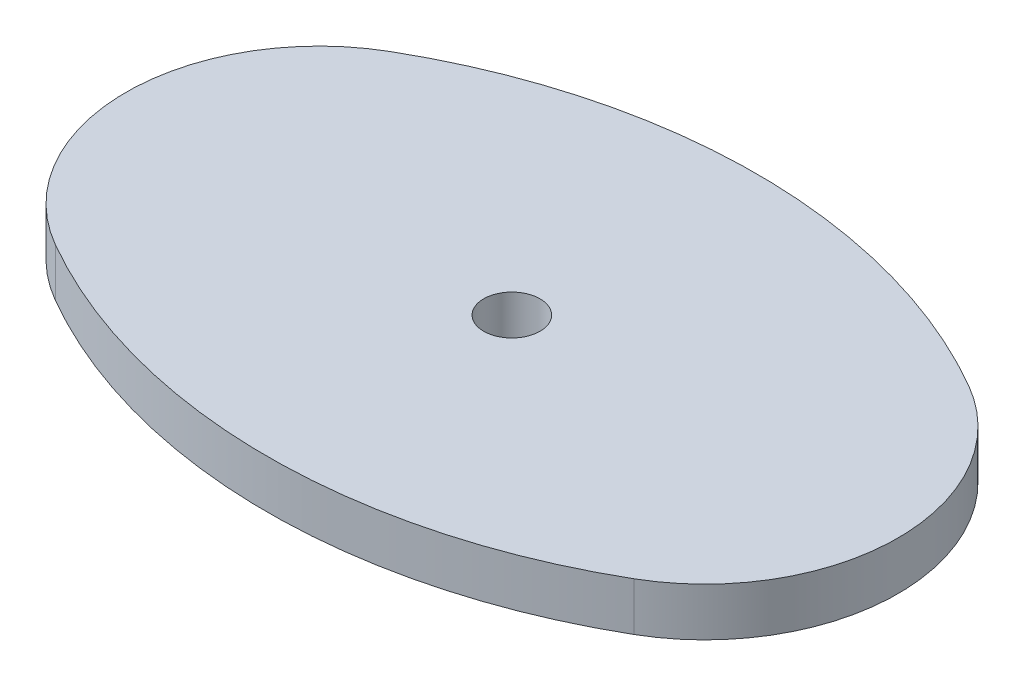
from build123d import *

# Parameters (mm, degrees)
SKETCH1_R      = 1.75
EXTRUDE1_DEPTH = 3


with BuildPart() as part:
    # Sketch1 → Extrude1 (new body)
    with BuildSketch(Plane(origin=(0, 0, 0), x_dir=(1, 0, 0), z_dir=(0, 1, 0))):
        with BuildLine():
            ThreePointArc((-17.974078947, -10.395296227), (-23.979263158, 0), (-17.974078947, 10.395296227))
            ThreePointArc((-17.974078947, 10.395296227), (0.010368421, 15.209407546), (17.994815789, 10.395296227))
            ThreePointArc((17.994815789, 10.395296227), (24, 0), (17.994815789, -10.395296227))
            ThreePointArc((17.994815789, -10.395296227), (0.010368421, -15.209407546), (-17.974078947, -10.395296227))
        make_face()
        with Locations(Location((0, 0, 0), (0, 0, 270))):
            Circle(SKETCH1_R, mode=Mode.SUBTRACT)
    extrude(amount=EXTRUDE1_DEPTH)


solid = part.part
